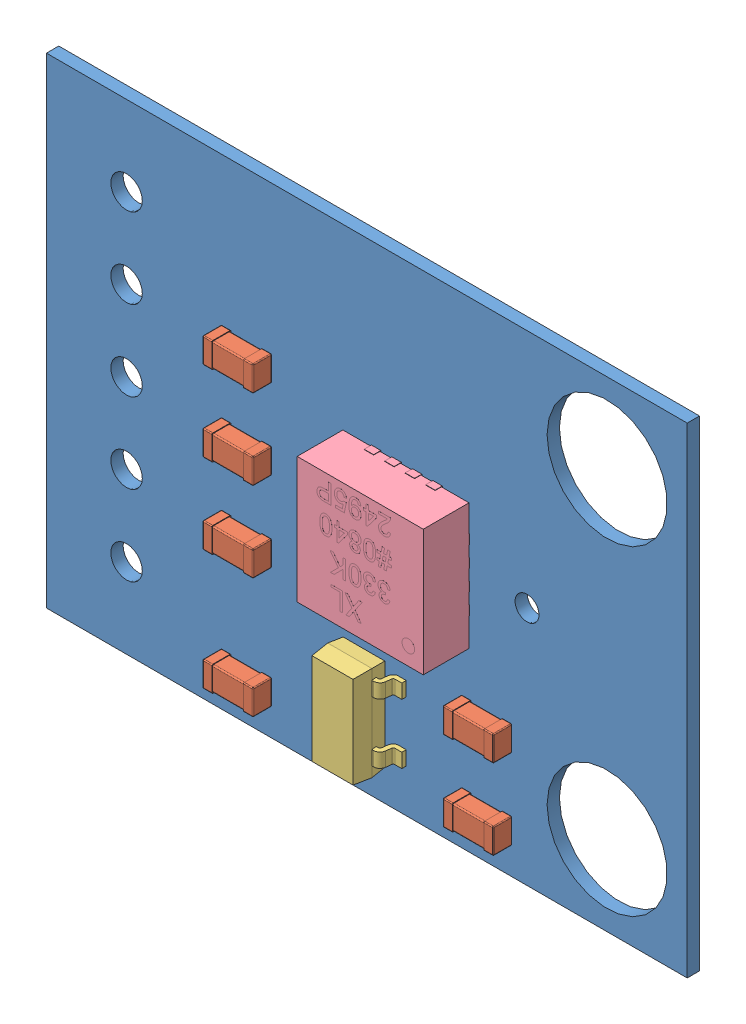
SolidWorks assembly User Library-GY-61.sldasm, configuration Default (file format 13000). Lengths in mm.
Overall size (20.32 15.24 1.88).
17 component instances, 4 part files, 0 mates.
Components (placement in the parent):
- User Library-GY-61_Board-1: User Library-GY-61_Board.sldprt [Default] at (0 0 -0.3912) size (20.32 15.24 0.39)
- User Library-GY-61_Designator9-1: User Library-GY-61_Designator9.SLDASM [Default] at origin size (1.6 0.8 0.6)
  - User Library-GY-61_User_Library-cap_0603_lowprofile-1: User Library-GY-61_User_Library-cap_0603_lowprofile.sldprt [Default] at (6.35 10.16 0) x (-1 0 0) z (0 0 1) size (1.6 0.8 0.6)
- User Library-GY-61_Designator10-1: User Library-GY-61_Designator10.SLDASM [Default] at origin size (1.6 0.8 0.6)
  - User Library-GY-61_User_Library-cap_0603_lowprofile-1: User Library-GY-61_User_Library-cap_0603_lowprofile.sldprt [Default] at (6.35 7.62 0) x (-1 0 0) z (0 0 1) size (1.6 0.8 0.6)
- User Library-GY-61_Designator11-1: User Library-GY-61_Designator11.SLDASM [Default] at origin size (1.6 0.8 0.6)
  - User Library-GY-61_User_Library-cap_0603_lowprofile-1: User Library-GY-61_User_Library-cap_0603_lowprofile.sldprt [Default] at (6.35 5.08 0) x (-1 0 0) z (0 0 1) size (1.6 0.8 0.6)
- User Library-GY-61_Designator12-1: User Library-GY-61_Designator12.SLDASM [Default] at origin size (1.6 0.8 0.6)
  - User Library-GY-61_User_Library-cap_0603_lowprofile-1: User Library-GY-61_User_Library-cap_0603_lowprofile.sldprt [Default] at (6.35 1.27 0) x (-1 0 0) z (0 0 1) size (1.6 0.8 0.6)
- User Library-GY-61_Designator13-1: User Library-GY-61_Designator13.SLDASM [Default] at origin size (1.6 0.8 0.6)
  - User Library-GY-61_User_Library-cap_0603_lowprofile-1: User Library-GY-61_User_Library-cap_0603_lowprofile.sldprt [Default] at (13.97 3.81 0) x (-1 0 0) z (0 0 1) size (1.6 0.8 0.6)
- User Library-GY-61_Designator14-1: User Library-GY-61_Designator14.SLDASM [Default] at origin size (1.6 0.8 0.6)
  - User Library-GY-61_User_Library-cap_0603_lowprofile-1: User Library-GY-61_User_Library-cap_0603_lowprofile.sldprt [Default] at (13.97 1.27 0) x (-1 0 0) z (0 0 1) size (1.6 0.8 0.6)
- User Library-GY-61_Designator10_2-1: User Library-GY-61_Designator10_2.SLDASM [Default] at origin size (2.5 3 1.1)
  - User Library-GY-61_SOT_23-1: User Library-GY-61_SOT_23.sldprt [Default] at (10.1599 2.5399 0.54) x (0 -1 0) z (-1 0 0) size (3 1.1 2.5)
- User Library-GY-61_Free-Models-1: User Library-GY-61_Free-Models.SLDASM [Default] at origin size (4.01 4.01 1.49)
  - User Library-GY-61_SW3dPS-ADXL330-1: User Library-GY-61_SW3dPS-ADXL330.sldprt [Default] at (11.43 7.62 0) x (-1 0 0) z (0 1 0) size (4.01 1.49 4.01)
